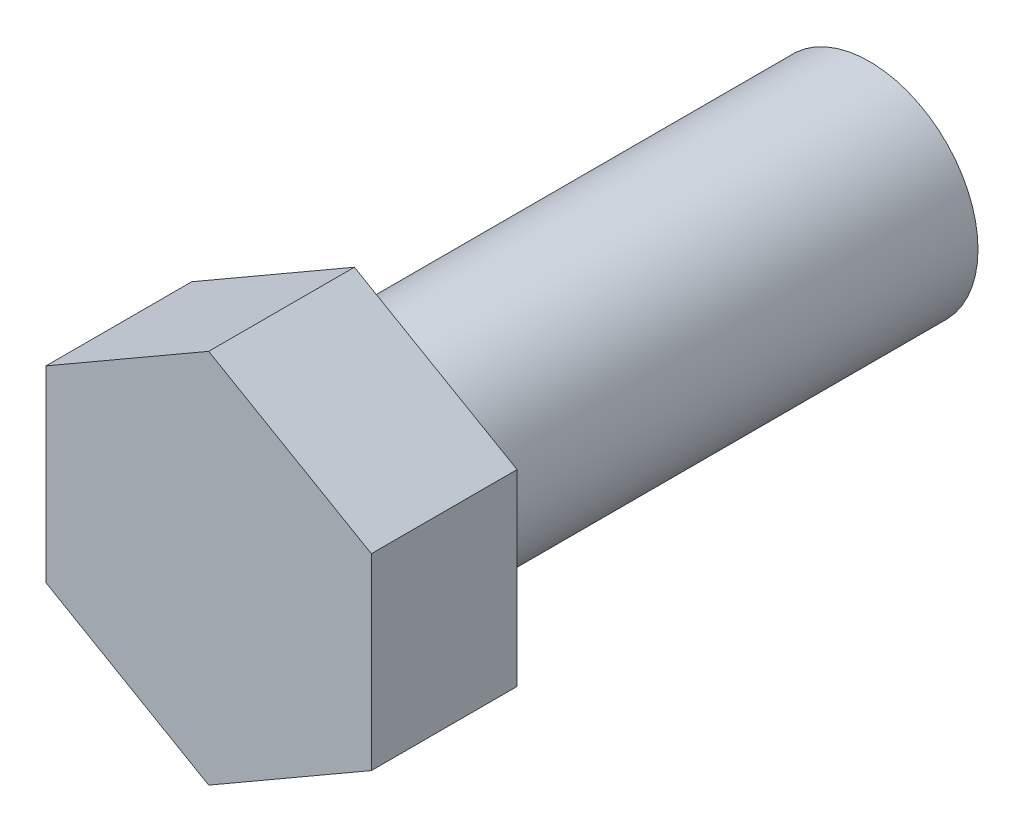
from build123d import *

# Parameters (mm, degrees)
BOLT_HEAD_DEPTH = 68.2625
SK_BODY_R       = 50.8
BOLT_BODY_DEPTH = 241.3


with BuildPart() as part:
    # Sketch3 → bolt Head (new body)
    with BuildSketch(Plane(origin=(0, 0, 0), x_dir=(0, 1, 0), z_dir=(0, 0, 1))):
        Polygon((87.988181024, 0), (43.994090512, 76.2), (-43.994090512, 76.2), (-87.988181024, 0), (-43.994090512, -76.2), (43.994090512, -76.2), align=None)
    extrude(amount=BOLT_HEAD_DEPTH)

    # sk body → bolt Body (add)
    with BuildSketch(Plane(origin=(0, 0, 0), x_dir=(0, 1, 0), z_dir=(0, 0, 1))):
        with Locations(Location((0, 0, 0), (0, 0, 270))):
            Circle(SK_BODY_R)
    extrude(amount=-BOLT_BODY_DEPTH)


solid = part.part
